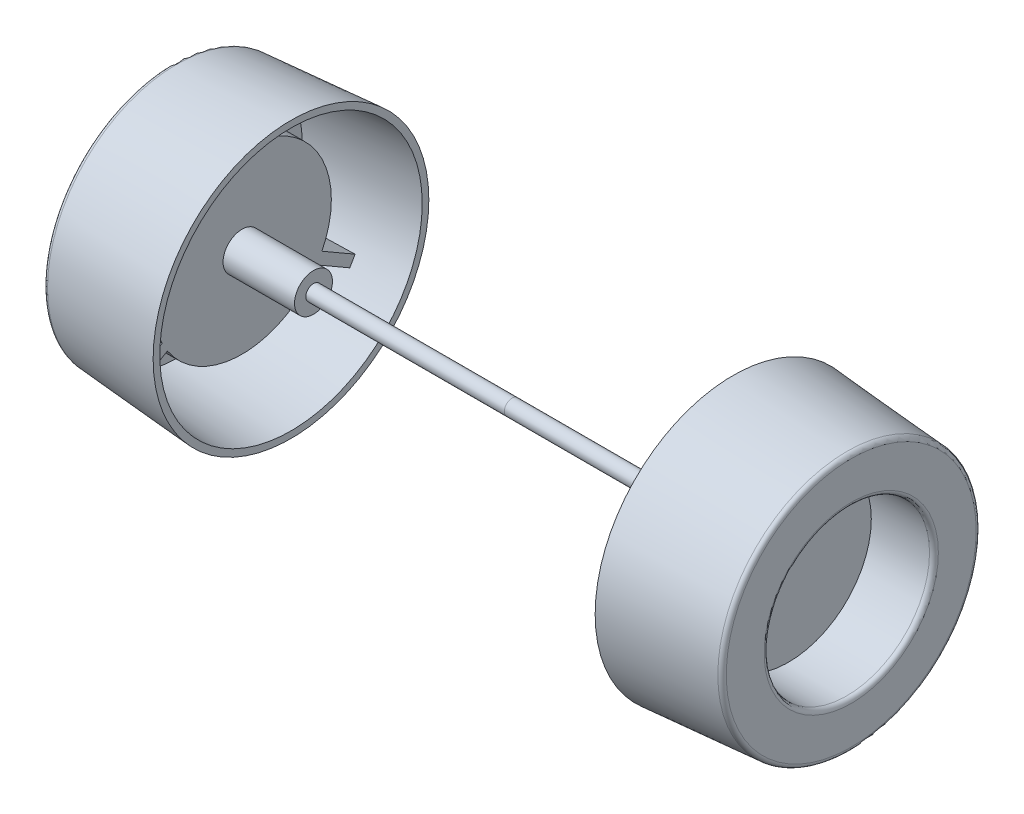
from build123d import *

# Parameters (mm, degrees)
CROQUIS2_R            = 31.25
CROQUIS1_R            = 29.25
CROQUIS3_R            = 18.75
CORTAR_EXTRUIR1_DEPTH = 14.2
VACIADO1_T            = -1.5
EXTRUIR1_START        = -8
EXTRUIR1_DEPTH        = 8
CROQUIS5_R            = 4.3
CROQUIS5_R_2          = 1.745
EXTRUIR2_DEPTH        = 16.2
REDONDEO1_R           = 1
CROQUIS6_R            = 1.745
EXTRUIR3_DEPTH        = 45


with BuildPart() as part:
    # Croquis2 → Recubrir1 section 0
    with BuildSketch(Plane(origin=(-26.8, 0, 0), x_dir=(0, 0, -1), z_dir=(1, 0, 0))):
        Circle(CROQUIS2_R)
    # Croquis1 → Recubrir1 section 1
    with BuildSketch(Plane(origin=(0, 0, 0), x_dir=(0, 0, -1), z_dir=(1, 0, 0))):
        Circle(CROQUIS1_R)
    loft()

    # Croquis3 → Cortar-Extruir1 (cut)
    with BuildSketch(Plane(origin=(0, 0, 0), x_dir=(0, 0, -1), z_dir=(1, 0, 0))):
        Circle(CROQUIS3_R)
    extrude(amount=-CORTAR_EXTRUIR1_DEPTH, mode=Mode.SUBTRACT)

    # Vaciado1
    vaciado1_openings = [part.faces().sort_by_distance(p)[0] for p in [
        (-26.8, 0, 0),
    ]]
    offset(amount=VACIADO1_T, openings=vaciado1_openings, kind=Kind.INTERSECTION)

    # Croquis4 → Extruir1 (add)
    with BuildSketch(Plane.ZY.offset(15.7).offset(EXTRUIR1_START)):
        with BuildLine():
            Line((1.202336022, 20.214274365), (1.202336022, 29.721519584))
            ThreePointArc((1.202336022, 29.721519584), (0, 29.745828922), (-1.202336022, 29.721519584))
            Line((-1.202336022, 29.721519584), (-1.202336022, 20.214274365))
            ThreePointArc((-1.202336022, 20.214274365), (0, 20.25), (1.202336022, 20.214274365))
        make_face()
        with BuildLine():
            Line((16.904907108, -11.148390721), (25.138422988, -15.902013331))
            ThreePointArc((25.138422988, -15.902013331), (25.760643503, -14.872914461), (26.34075901, -13.819506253))
            Line((26.34075901, -13.819506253), (18.10724313, -9.065883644))
            ThreePointArc((18.10724313, -9.065883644), (17.537014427, -10.125), (16.904907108, -11.148390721))
        make_face()
        with BuildLine():
            Line((-18.10724313, -9.065883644), (-26.34075901, -13.819506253))
            ThreePointArc((-26.34075901, -13.819506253), (-25.760643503, -14.872914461), (-25.138422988, -15.902013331))
            Line((-25.138422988, -15.902013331), (-16.904907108, -11.148390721))
            ThreePointArc((-16.904907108, -11.148390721), (-17.537014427, -10.125), (-18.10724313, -9.065883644))
        make_face()
    extrude(amount=EXTRUIR1_DEPTH)

    # Croquis5 → Extruir2 (add)
    with BuildSketch(Plane.ZY.offset(15.7)):
        with Locations(Location((0, 0, 0), (0, 0, 180))):
            Circle(CROQUIS5_R)
        Circle(CROQUIS5_R_2, mode=Mode.SUBTRACT)
    extrude(amount=EXTRUIR2_DEPTH)

    # Redondeo1
    redondeo1_edges = [part.edges().sort_by_distance(p)[0] for p in [
        (0, 0, 29.25),
        (0, 0, 18.75),
    ]]
    fillet(redondeo1_edges, radius=REDONDEO1_R)


with BuildPart() as body_2:
    # Croquis6 → Extruir3 (new body)
    with BuildSketch(Plane.ZY.offset(31.9)):
        with Locations(Location((0, 0, 0), (0, 0, 180))):
            Circle(CROQUIS6_R)
    extrude(amount=EXTRUIR3_DEPTH)


with BuildPart() as body_3:
    # Simetr_a1: mirrored copy
    add(part.part.mirror(Plane.ZY.offset(76.9)))


with BuildPart() as body_4:
    # Simetr_a1 2: mirrored copy
    add(body_2.part.mirror(Plane.ZY.offset(76.9)))


solid = Compound([part.part, body_2.part, body_3.part, body_4.part])
